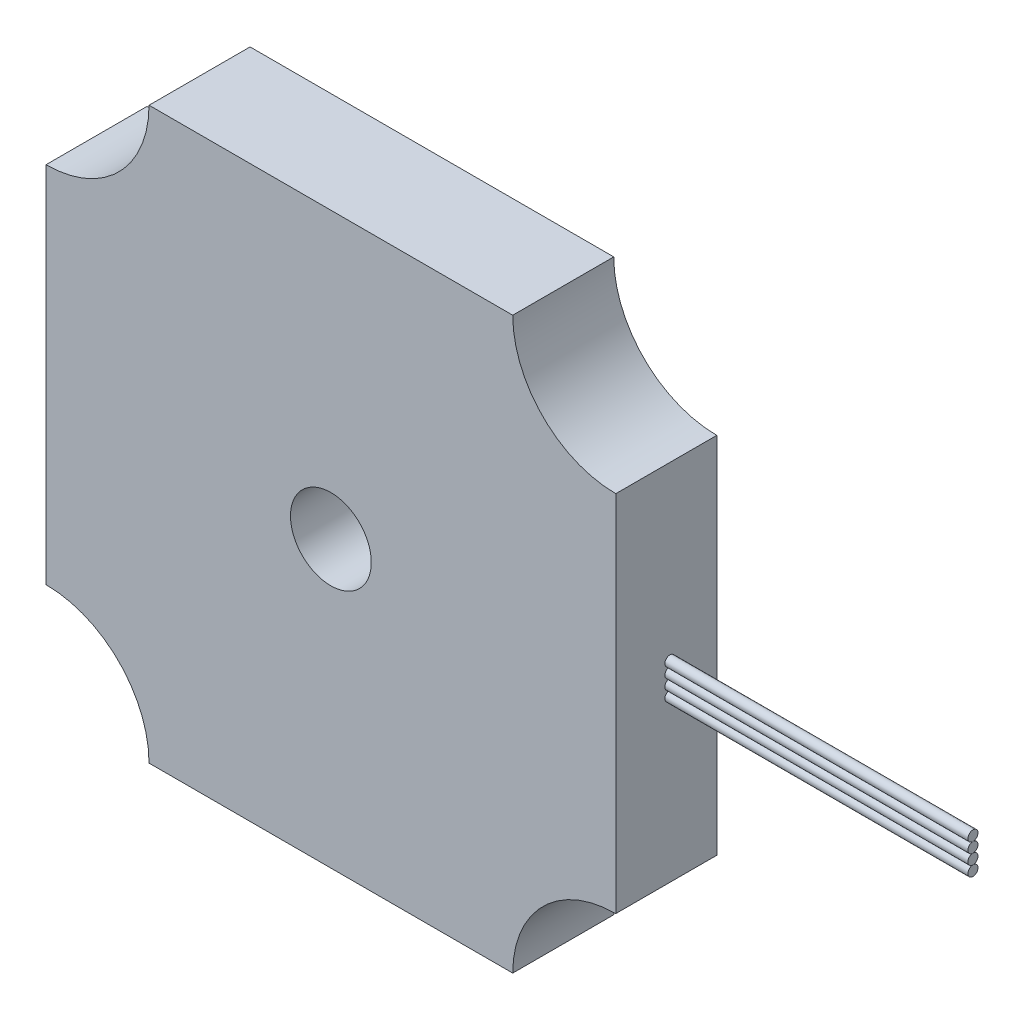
ISO-10303-21;
HEADER;
FILE_DESCRIPTION(('STEP AP214'),'2;1');
FILE_NAME('part.step','',(''),(''),'','','');
FILE_SCHEMA(('AUTOMOTIVE_DESIGN { 1 0 10303 214 1 1 1 1 }'));
ENDSEC;
DATA;
#1=APPLICATION_CONTEXT('core data for automotive mechanical design processes');
#2=APPLICATION_PROTOCOL_DEFINITION('international standard','automotive_design',2000,#1);
#3=PRODUCT_CONTEXT('',#1,'mechanical');
#4=PRODUCT('Part','Part','',(#3));
#5=PRODUCT_RELATED_PRODUCT_CATEGORY('part','',(#4));
#6=PRODUCT_DEFINITION_FORMATION('','',#4);
#7=PRODUCT_DEFINITION_CONTEXT('part definition',#1,'design');
#8=PRODUCT_DEFINITION('design','',#6,#7);
#9=PRODUCT_DEFINITION_SHAPE('','',#8);
#10=(LENGTH_UNIT() NAMED_UNIT(*) SI_UNIT(.MILLI.,.METRE.));
#11=(NAMED_UNIT(*) PLANE_ANGLE_UNIT() SI_UNIT($,.RADIAN.));
#12=(NAMED_UNIT(*) SI_UNIT($,.STERADIAN.) SOLID_ANGLE_UNIT());
#13=UNCERTAINTY_MEASURE_WITH_UNIT(LENGTH_MEASURE(1.E-05),#10,'distance_accuracy_value','');
#14=(GEOMETRIC_REPRESENTATION_CONTEXT(3) GLOBAL_UNCERTAINTY_ASSIGNED_CONTEXT((#13)) GLOBAL_UNIT_ASSIGNED_CONTEXT((#10,
#11,#12)) REPRESENTATION_CONTEXT('',''));
#15=CARTESIAN_POINT('',(0.,0.,0.));
#16=DIRECTION('',(0.,0.,1.));
#17=DIRECTION('',(1.,0.,0.));
#18=AXIS2_PLACEMENT_3D('',#15,#16,#17);
#19=CARTESIAN_POINT('',(58.2,-2.,4.64344868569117));
#20=DIRECTION('',(-1.,0.,0.));
#21=DIRECTION('',(0.,0.,1.));
#22=AXIS2_PLACEMENT_3D('',#19,#20,#21);
#23=CYLINDRICAL_SURFACE('',#22,0.500000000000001);
#24=CARTESIAN_POINT('',(28.2,-2.,4.64344868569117));
#25=DIRECTION('',(1.,0.,0.));
#26=DIRECTION('',(0.,0.,-1.));
#27=AXIS2_PLACEMENT_3D('',#24,#25,#26);
#28=CIRCLE('',#27,0.500000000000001);
#29=CARTESIAN_POINT('',(28.2,-2.,4.14344868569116));
#30=VERTEX_POINT('',#29);
#31=EDGE_CURVE('E12',#30,#30,#28,.T.);
#32=ORIENTED_EDGE('',*,*,#31,.T.);
#33=EDGE_LOOP('',(#32));
#34=FACE_BOUND('',#33,.T.);
#35=CARTESIAN_POINT('',(58.2,-2.,4.64344868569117));
#36=DIRECTION('',(1.,0.,0.));
#37=DIRECTION('',(0.,0.,-1.));
#38=AXIS2_PLACEMENT_3D('',#35,#36,#37);
#39=CIRCLE('',#38,0.500000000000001);
#40=CARTESIAN_POINT('',(58.2,-2.,4.14344868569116));
#41=VERTEX_POINT('',#40);
#42=EDGE_CURVE('E56',#41,#41,#39,.T.);
#43=ORIENTED_EDGE('',*,*,#42,.F.);
#44=EDGE_LOOP('',(#43));
#45=FACE_BOUND('',#44,.T.);
#46=ADVANCED_FACE('F52',(#34,#45),#23,.T.);
#47=CARTESIAN_POINT('',(58.2,-2.,4.64344868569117));
#48=DIRECTION('',(1.,0.,0.));
#49=DIRECTION('',(0.,0.,-1.));
#50=AXIS2_PLACEMENT_3D('',#47,#48,#49);
#51=PLANE('',#50);
#52=ORIENTED_EDGE('',*,*,#42,.T.);
#53=EDGE_LOOP('',(#52));
#54=FACE_BOUND('',#53,.T.);
#55=ADVANCED_FACE('F54',(#54),#51,.T.);
#56=CARTESIAN_POINT('',(28.2,-2.,4.64344868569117));
#57=DIRECTION('',(1.,0.,0.));
#58=DIRECTION('',(0.,0.,-1.));
#59=AXIS2_PLACEMENT_3D('',#56,#57,#58);
#60=PLANE('',#59);
#61=ORIENTED_EDGE('',*,*,#31,.F.);
#62=EDGE_LOOP('',(#61));
#63=FACE_BOUND('',#62,.T.);
#64=ADVANCED_FACE('F71',(#63),#60,.F.);
#65=CLOSED_SHELL('',(#46,#55,#64));
#66=MANIFOLD_SOLID_BREP('B2',#65);
#67=CARTESIAN_POINT('',(58.2,-1.,4.64344868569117));
#68=DIRECTION('',(-1.,0.,0.));
#69=DIRECTION('',(0.,0.,1.));
#70=AXIS2_PLACEMENT_3D('',#67,#68,#69);
#71=CYLINDRICAL_SURFACE('',#70,0.500000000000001);
#72=CARTESIAN_POINT('',(28.2,-1.,4.64344868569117));
#73=DIRECTION('',(1.,0.,0.));
#74=DIRECTION('',(0.,0.,-1.));
#75=AXIS2_PLACEMENT_3D('',#72,#73,#74);
#76=CIRCLE('',#75,0.500000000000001);
#77=CARTESIAN_POINT('',(28.2,-1.,4.14344868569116));
#78=VERTEX_POINT('',#77);
#79=EDGE_CURVE('E51',#78,#78,#76,.T.);
#80=ORIENTED_EDGE('',*,*,#79,.T.);
#81=EDGE_LOOP('',(#80));
#82=FACE_BOUND('',#81,.T.);
#83=CARTESIAN_POINT('',(58.2,-1.,4.64344868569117));
#84=DIRECTION('',(1.,0.,0.));
#85=DIRECTION('',(0.,0.,-1.));
#86=AXIS2_PLACEMENT_3D('',#83,#84,#85);
#87=CIRCLE('',#86,0.500000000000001);
#88=CARTESIAN_POINT('',(58.2,-1.,4.14344868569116));
#89=VERTEX_POINT('',#88);
#90=EDGE_CURVE('E105',#89,#89,#87,.T.);
#91=ORIENTED_EDGE('',*,*,#90,.F.);
#92=EDGE_LOOP('',(#91));
#93=FACE_BOUND('',#92,.T.);
#94=ADVANCED_FACE('F101',(#82,#93),#71,.T.);
#95=CARTESIAN_POINT('',(58.2,-1.,4.64344868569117));
#96=DIRECTION('',(1.,0.,0.));
#97=DIRECTION('',(0.,0.,-1.));
#98=AXIS2_PLACEMENT_3D('',#95,#96,#97);
#99=PLANE('',#98);
#100=ORIENTED_EDGE('',*,*,#90,.T.);
#101=EDGE_LOOP('',(#100));
#102=FACE_BOUND('',#101,.T.);
#103=ADVANCED_FACE('F103',(#102),#99,.T.);
#104=CARTESIAN_POINT('',(28.2,-1.,4.64344868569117));
#105=DIRECTION('',(1.,0.,0.));
#106=DIRECTION('',(0.,0.,-1.));
#107=AXIS2_PLACEMENT_3D('',#104,#105,#106);
#108=PLANE('',#107);
#109=ORIENTED_EDGE('',*,*,#79,.F.);
#110=EDGE_LOOP('',(#109));
#111=FACE_BOUND('',#110,.T.);
#112=ADVANCED_FACE('F120',(#111),#108,.F.);
#113=CLOSED_SHELL('',(#94,#103,#112));
#114=MANIFOLD_SOLID_BREP('B7',#113);
#115=CARTESIAN_POINT('',(58.2,0.,4.64344868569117));
#116=DIRECTION('',(-1.,0.,0.));
#117=DIRECTION('',(0.,0.,1.));
#118=AXIS2_PLACEMENT_3D('',#115,#116,#117);
#119=CYLINDRICAL_SURFACE('',#118,0.500000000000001);
#120=CARTESIAN_POINT('',(28.2,0.,4.64344868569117));
#121=DIRECTION('',(1.,0.,0.));
#122=DIRECTION('',(0.,0.,-1.));
#123=AXIS2_PLACEMENT_3D('',#120,#121,#122);
#124=CIRCLE('',#123,0.500000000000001);
#125=CARTESIAN_POINT('',(28.2,0.,4.14344868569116));
#126=VERTEX_POINT('',#125);
#127=EDGE_CURVE('E100',#126,#126,#124,.T.);
#128=ORIENTED_EDGE('',*,*,#127,.T.);
#129=EDGE_LOOP('',(#128));
#130=FACE_BOUND('',#129,.T.);
#131=CARTESIAN_POINT('',(58.2,0.,4.64344868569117));
#132=DIRECTION('',(1.,0.,0.));
#133=DIRECTION('',(0.,0.,-1.));
#134=AXIS2_PLACEMENT_3D('',#131,#132,#133);
#135=CIRCLE('',#134,0.500000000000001);
#136=CARTESIAN_POINT('',(58.2,0.,4.14344868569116));
#137=VERTEX_POINT('',#136);
#138=EDGE_CURVE('E154',#137,#137,#135,.T.);
#139=ORIENTED_EDGE('',*,*,#138,.F.);
#140=EDGE_LOOP('',(#139));
#141=FACE_BOUND('',#140,.T.);
#142=ADVANCED_FACE('F150',(#130,#141),#119,.T.);
#143=CARTESIAN_POINT('',(58.2,0.,4.64344868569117));
#144=DIRECTION('',(1.,0.,0.));
#145=DIRECTION('',(0.,0.,-1.));
#146=AXIS2_PLACEMENT_3D('',#143,#144,#145);
#147=PLANE('',#146);
#148=ORIENTED_EDGE('',*,*,#138,.T.);
#149=EDGE_LOOP('',(#148));
#150=FACE_BOUND('',#149,.T.);
#151=ADVANCED_FACE('F152',(#150),#147,.T.);
#152=CARTESIAN_POINT('',(28.2,0.,4.64344868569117));
#153=DIRECTION('',(1.,0.,0.));
#154=DIRECTION('',(0.,0.,-1.));
#155=AXIS2_PLACEMENT_3D('',#152,#153,#154);
#156=PLANE('',#155);
#157=ORIENTED_EDGE('',*,*,#127,.F.);
#158=EDGE_LOOP('',(#157));
#159=FACE_BOUND('',#158,.T.);
#160=ADVANCED_FACE('F169',(#159),#156,.F.);
#161=CLOSED_SHELL('',(#142,#151,#160));
#162=MANIFOLD_SOLID_BREP('B46',#161);
#163=CARTESIAN_POINT('',(58.2,1.,4.64344868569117));
#164=DIRECTION('',(-1.,0.,0.));
#165=DIRECTION('',(0.,0.,1.));
#166=AXIS2_PLACEMENT_3D('',#163,#164,#165);
#167=CYLINDRICAL_SURFACE('',#166,0.500000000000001);
#168=CARTESIAN_POINT('',(28.2,1.,4.64344868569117));
#169=DIRECTION('',(1.,0.,0.));
#170=DIRECTION('',(0.,0.,-1.));
#171=AXIS2_PLACEMENT_3D('',#168,#169,#170);
#172=CIRCLE('',#171,0.500000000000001);
#173=CARTESIAN_POINT('',(28.2,1.,4.14344868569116));
#174=VERTEX_POINT('',#173);
#175=EDGE_CURVE('E203',#174,#174,#172,.T.);
#176=ORIENTED_EDGE('',*,*,#175,.T.);
#177=EDGE_LOOP('',(#176));
#178=FACE_BOUND('',#177,.T.);
#179=CARTESIAN_POINT('',(58.2,1.,4.64344868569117));
#180=DIRECTION('',(1.,0.,0.));
#181=DIRECTION('',(0.,0.,-1.));
#182=AXIS2_PLACEMENT_3D('',#179,#180,#181);
#183=CIRCLE('',#182,0.500000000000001);
#184=CARTESIAN_POINT('',(58.2,1.,4.14344868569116));
#185=VERTEX_POINT('',#184);
#186=EDGE_CURVE('E149',#185,#185,#183,.T.);
#187=ORIENTED_EDGE('',*,*,#186,.F.);
#188=EDGE_LOOP('',(#187));
#189=FACE_BOUND('',#188,.T.);
#190=ADVANCED_FACE('F200',(#178,#189),#167,.T.);
#191=CARTESIAN_POINT('',(58.2,1.,4.64344868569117));
#192=DIRECTION('',(1.,0.,0.));
#193=DIRECTION('',(0.,0.,-1.));
#194=AXIS2_PLACEMENT_3D('',#191,#192,#193);
#195=PLANE('',#194);
#196=ORIENTED_EDGE('',*,*,#186,.T.);
#197=EDGE_LOOP('',(#196));
#198=FACE_BOUND('',#197,.T.);
#199=ADVANCED_FACE('F216',(#198),#195,.T.);
#200=CARTESIAN_POINT('',(28.2,1.,4.64344868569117));
#201=DIRECTION('',(1.,0.,0.));
#202=DIRECTION('',(0.,0.,-1.));
#203=AXIS2_PLACEMENT_3D('',#200,#201,#202);
#204=PLANE('',#203);
#205=ORIENTED_EDGE('',*,*,#175,.F.);
#206=EDGE_LOOP('',(#205));
#207=FACE_BOUND('',#206,.T.);
#208=ADVANCED_FACE('F214',(#207),#204,.F.);
#209=CLOSED_SHELL('',(#190,#199,#208));
#210=MANIFOLD_SOLID_BREP('B95',#209);
#211=CARTESIAN_POINT('',(-28.2,28.2,10.));
#212=DIRECTION('',(0.,0.,-1.));
#213=DIRECTION('',(-1.,0.,0.));
#214=AXIS2_PLACEMENT_3D('',#211,#212,#213);
#215=CYLINDRICAL_SURFACE('',#214,10.2);
#216=CARTESIAN_POINT('',(-28.2,28.2,0.));
#217=DIRECTION('',(0.,0.,-1.));
#218=DIRECTION('',(1.,0.,0.));
#219=AXIS2_PLACEMENT_3D('',#216,#217,#218);
#220=CIRCLE('',#219,10.2);
#221=CARTESIAN_POINT('',(-18.,28.2,0.));
#222=VERTEX_POINT('',#221);
#223=CARTESIAN_POINT('',(-28.2,18.,0.));
#224=VERTEX_POINT('',#223);
#225=EDGE_CURVE('E337',#222,#224,#220,.T.);
#226=ORIENTED_EDGE('',*,*,#225,.T.);
#227=DIRECTION('',(0.,0.,-1.));
#228=VECTOR('',#227,1.);
#229=CARTESIAN_POINT('',(-28.2,18.,10.));
#230=LINE('',#229,#228);
#231=CARTESIAN_POINT('',(-28.2,18.,10.));
#232=VERTEX_POINT('',#231);
#233=EDGE_CURVE('E198',#232,#224,#230,.T.);
#234=ORIENTED_EDGE('',*,*,#233,.F.);
#235=CARTESIAN_POINT('',(-28.2,28.2,10.));
#236=DIRECTION('',(0.,0.,-1.));
#237=DIRECTION('',(1.,0.,0.));
#238=AXIS2_PLACEMENT_3D('',#235,#236,#237);
#239=CIRCLE('',#238,10.2);
#240=CARTESIAN_POINT('',(-18.,28.2,10.));
#241=VERTEX_POINT('',#240);
#242=EDGE_CURVE('E352',#241,#232,#239,.T.);
#243=ORIENTED_EDGE('',*,*,#242,.F.);
#244=DIRECTION('',(0.,0.,-1.));
#245=VECTOR('',#244,1.);
#246=CARTESIAN_POINT('',(-18.,28.2,10.));
#247=LINE('',#246,#245);
#248=EDGE_CURVE('E333',#241,#222,#247,.T.);
#249=ORIENTED_EDGE('',*,*,#248,.T.);
#250=EDGE_LOOP('',(#226,#234,#243,#249));
#251=FACE_BOUND('',#250,.T.);
#252=ADVANCED_FACE('F241',(#251),#215,.F.);
#253=CARTESIAN_POINT('',(-28.2,-18.,10.));
#254=DIRECTION('',(1.,0.,0.));
#255=DIRECTION('',(0.,0.,-1.));
#256=AXIS2_PLACEMENT_3D('',#253,#254,#255);
#257=PLANE('',#256);
#258=DIRECTION('',(0.,-1.,0.));
#259=VECTOR('',#258,1.);
#260=CARTESIAN_POINT('',(-28.2,-18.,0.));
#261=LINE('',#260,#259);
#262=CARTESIAN_POINT('',(-28.2,-18.,0.));
#263=VERTEX_POINT('',#262);
#264=EDGE_CURVE('E340',#224,#263,#261,.T.);
#265=ORIENTED_EDGE('',*,*,#264,.T.);
#266=DIRECTION('',(0.,0.,-1.));
#267=VECTOR('',#266,1.);
#268=CARTESIAN_POINT('',(-28.2,-18.,10.));
#269=LINE('',#268,#267);
#270=CARTESIAN_POINT('',(-28.2,-18.,10.));
#271=VERTEX_POINT('',#270);
#272=EDGE_CURVE('E249',#271,#263,#269,.T.);
#273=ORIENTED_EDGE('',*,*,#272,.F.);
#274=DIRECTION('',(0.,-1.,0.));
#275=VECTOR('',#274,1.);
#276=CARTESIAN_POINT('',(-28.2,-18.,10.));
#277=LINE('',#276,#275);
#278=EDGE_CURVE('E300',#232,#271,#277,.T.);
#279=ORIENTED_EDGE('',*,*,#278,.F.);
#280=ORIENTED_EDGE('',*,*,#233,.T.);
#281=EDGE_LOOP('',(#265,#273,#279,#280));
#282=FACE_BOUND('',#281,.T.);
#283=ADVANCED_FACE('F407',(#282),#257,.F.);
#284=CARTESIAN_POINT('',(-28.2,-28.2,10.));
#285=DIRECTION('',(0.,0.,-1.));
#286=DIRECTION('',(-1.,0.,0.));
#287=AXIS2_PLACEMENT_3D('',#284,#285,#286);
#288=CYLINDRICAL_SURFACE('',#287,10.2);
#289=CARTESIAN_POINT('',(-28.2,-28.2,0.));
#290=DIRECTION('',(0.,0.,-1.));
#291=DIRECTION('',(1.,0.,0.));
#292=AXIS2_PLACEMENT_3D('',#289,#290,#291);
#293=CIRCLE('',#292,10.2);
#294=CARTESIAN_POINT('',(-18.,-28.2,0.));
#295=VERTEX_POINT('',#294);
#296=EDGE_CURVE('E343',#263,#295,#293,.T.);
#297=ORIENTED_EDGE('',*,*,#296,.T.);
#298=DIRECTION('',(0.,0.,-1.));
#299=VECTOR('',#298,1.);
#300=CARTESIAN_POINT('',(-18.,-28.2,10.));
#301=LINE('',#300,#299);
#302=CARTESIAN_POINT('',(-18.,-28.2,10.));
#303=VERTEX_POINT('',#302);
#304=EDGE_CURVE('E359',#303,#295,#301,.T.);
#305=ORIENTED_EDGE('',*,*,#304,.F.);
#306=CARTESIAN_POINT('',(-28.2,-28.2,10.));
#307=DIRECTION('',(0.,0.,-1.));
#308=DIRECTION('',(1.,0.,0.));
#309=AXIS2_PLACEMENT_3D('',#306,#307,#308);
#310=CIRCLE('',#309,10.2);
#311=EDGE_CURVE('E367',#271,#303,#310,.T.);
#312=ORIENTED_EDGE('',*,*,#311,.F.);
#313=ORIENTED_EDGE('',*,*,#272,.T.);
#314=EDGE_LOOP('',(#297,#305,#312,#313));
#315=FACE_BOUND('',#314,.T.);
#316=ADVANCED_FACE('F365',(#315),#288,.F.);
#317=CARTESIAN_POINT('',(-18.,-28.2,10.));
#318=DIRECTION('',(0.,1.,0.));
#319=DIRECTION('',(0.,0.,1.));
#320=AXIS2_PLACEMENT_3D('',#317,#318,#319);
#321=PLANE('',#320);
#322=DIRECTION('',(1.,0.,0.));
#323=VECTOR('',#322,1.);
#324=CARTESIAN_POINT('',(-18.,-28.2,0.));
#325=LINE('',#324,#323);
#326=CARTESIAN_POINT('',(18.,-28.2,0.));
#327=VERTEX_POINT('',#326);
#328=EDGE_CURVE('E345',#295,#327,#325,.T.);
#329=ORIENTED_EDGE('',*,*,#328,.T.);
#330=DIRECTION('',(0.,0.,-1.));
#331=VECTOR('',#330,1.);
#332=CARTESIAN_POINT('',(18.,-28.2,10.));
#333=LINE('',#332,#331);
#334=CARTESIAN_POINT('',(18.,-28.2,10.));
#335=VERTEX_POINT('',#334);
#336=EDGE_CURVE('E356',#335,#327,#333,.T.);
#337=ORIENTED_EDGE('',*,*,#336,.F.);
#338=DIRECTION('',(1.,0.,0.));
#339=VECTOR('',#338,1.);
#340=CARTESIAN_POINT('',(-18.,-28.2,10.));
#341=LINE('',#340,#339);
#342=EDGE_CURVE('E379',#303,#335,#341,.T.);
#343=ORIENTED_EDGE('',*,*,#342,.F.);
#344=ORIENTED_EDGE('',*,*,#304,.T.);
#345=EDGE_LOOP('',(#329,#337,#343,#344));
#346=FACE_BOUND('',#345,.T.);
#347=ADVANCED_FACE('F375',(#346),#321,.F.);
#348=CARTESIAN_POINT('',(28.2,-28.2,10.));
#349=DIRECTION('',(0.,0.,-1.));
#350=DIRECTION('',(-1.,0.,0.));
#351=AXIS2_PLACEMENT_3D('',#348,#349,#350);
#352=CYLINDRICAL_SURFACE('',#351,10.2);
#353=CARTESIAN_POINT('',(28.2,-28.2,0.));
#354=DIRECTION('',(0.,0.,-1.));
#355=DIRECTION('',(1.,0.,0.));
#356=AXIS2_PLACEMENT_3D('',#353,#354,#355);
#357=CIRCLE('',#356,10.2);
#358=CARTESIAN_POINT('',(28.2,-18.,0.));
#359=VERTEX_POINT('',#358);
#360=EDGE_CURVE('E347',#327,#359,#357,.T.);
#361=ORIENTED_EDGE('',*,*,#360,.T.);
#362=DIRECTION('',(0.,0.,-1.));
#363=VECTOR('',#362,1.);
#364=CARTESIAN_POINT('',(28.2,-18.,10.));
#365=LINE('',#364,#363);
#366=CARTESIAN_POINT('',(28.2,-18.,10.));
#367=VERTEX_POINT('',#366);
#368=EDGE_CURVE('E328',#367,#359,#365,.T.);
#369=ORIENTED_EDGE('',*,*,#368,.F.);
#370=CARTESIAN_POINT('',(28.2,-28.2,10.));
#371=DIRECTION('',(0.,0.,-1.));
#372=DIRECTION('',(1.,0.,0.));
#373=AXIS2_PLACEMENT_3D('',#370,#371,#372);
#374=CIRCLE('',#373,10.2);
#375=EDGE_CURVE('E319',#335,#367,#374,.T.);
#376=ORIENTED_EDGE('',*,*,#375,.F.);
#377=ORIENTED_EDGE('',*,*,#336,.T.);
#378=EDGE_LOOP('',(#361,#369,#376,#377));
#379=FACE_BOUND('',#378,.T.);
#380=ADVANCED_FACE('F378',(#379),#352,.F.);
#381=CARTESIAN_POINT('',(28.2,-18.,10.));
#382=DIRECTION('',(-1.,0.,0.));
#383=DIRECTION('',(0.,0.,1.));
#384=AXIS2_PLACEMENT_3D('',#381,#382,#383);
#385=PLANE('',#384);
#386=DIRECTION('',(0.,1.,0.));
#387=VECTOR('',#386,1.);
#388=CARTESIAN_POINT('',(28.2,-18.,0.));
#389=LINE('',#388,#387);
#390=CARTESIAN_POINT('',(28.2,18.,0.));
#391=VERTEX_POINT('',#390);
#392=EDGE_CURVE('E327',#359,#391,#389,.T.);
#393=ORIENTED_EDGE('',*,*,#392,.T.);
#394=DIRECTION('',(0.,0.,-1.));
#395=VECTOR('',#394,1.);
#396=CARTESIAN_POINT('',(28.2,18.,10.));
#397=LINE('',#396,#395);
#398=CARTESIAN_POINT('',(28.2,18.,10.));
#399=VERTEX_POINT('',#398);
#400=EDGE_CURVE('E324',#399,#391,#397,.T.);
#401=ORIENTED_EDGE('',*,*,#400,.F.);
#402=DIRECTION('',(0.,1.,0.));
#403=VECTOR('',#402,1.);
#404=CARTESIAN_POINT('',(28.2,-18.,10.));
#405=LINE('',#404,#403);
#406=EDGE_CURVE('E313',#367,#399,#405,.T.);
#407=ORIENTED_EDGE('',*,*,#406,.F.);
#408=ORIENTED_EDGE('',*,*,#368,.T.);
#409=EDGE_LOOP('',(#393,#401,#407,#408));
#410=FACE_BOUND('',#409,.T.);
#411=ADVANCED_FACE('F325',(#410),#385,.F.);
#412=CARTESIAN_POINT('',(28.2,28.2,10.));
#413=DIRECTION('',(0.,0.,-1.));
#414=DIRECTION('',(-1.,0.,0.));
#415=AXIS2_PLACEMENT_3D('',#412,#413,#414);
#416=CYLINDRICAL_SURFACE('',#415,10.2);
#417=CARTESIAN_POINT('',(28.2,28.2,0.));
#418=DIRECTION('',(0.,0.,-1.));
#419=DIRECTION('',(1.,0.,0.));
#420=AXIS2_PLACEMENT_3D('',#417,#418,#419);
#421=CIRCLE('',#420,10.2);
#422=CARTESIAN_POINT('',(18.,28.2,0.));
#423=VERTEX_POINT('',#422);
#424=EDGE_CURVE('E286',#391,#423,#421,.T.);
#425=ORIENTED_EDGE('',*,*,#424,.T.);
#426=DIRECTION('',(0.,0.,-1.));
#427=VECTOR('',#426,1.);
#428=CARTESIAN_POINT('',(18.,28.2,10.));
#429=LINE('',#428,#427);
#430=CARTESIAN_POINT('',(18.,28.2,10.));
#431=VERTEX_POINT('',#430);
#432=EDGE_CURVE('E329',#431,#423,#429,.T.);
#433=ORIENTED_EDGE('',*,*,#432,.F.);
#434=CARTESIAN_POINT('',(28.2,28.2,10.));
#435=DIRECTION('',(0.,0.,-1.));
#436=DIRECTION('',(1.,0.,0.));
#437=AXIS2_PLACEMENT_3D('',#434,#435,#436);
#438=CIRCLE('',#437,10.2);
#439=EDGE_CURVE('E317',#399,#431,#438,.T.);
#440=ORIENTED_EDGE('',*,*,#439,.F.);
#441=ORIENTED_EDGE('',*,*,#400,.T.);
#442=EDGE_LOOP('',(#425,#433,#440,#441));
#443=FACE_BOUND('',#442,.T.);
#444=ADVANCED_FACE('F331',(#443),#416,.F.);
#445=CARTESIAN_POINT('',(18.,28.2,10.));
#446=DIRECTION('',(0.,-1.,0.));
#447=DIRECTION('',(0.,0.,-1.));
#448=AXIS2_PLACEMENT_3D('',#445,#446,#447);
#449=PLANE('',#448);
#450=DIRECTION('',(-1.,0.,0.));
#451=VECTOR('',#450,1.);
#452=CARTESIAN_POINT('',(18.,28.2,0.));
#453=LINE('',#452,#451);
#454=EDGE_CURVE('E292',#423,#222,#453,.T.);
#455=ORIENTED_EDGE('',*,*,#454,.T.);
#456=ORIENTED_EDGE('',*,*,#248,.F.);
#457=DIRECTION('',(-1.,0.,0.));
#458=VECTOR('',#457,1.);
#459=CARTESIAN_POINT('',(18.,28.2,10.));
#460=LINE('',#459,#458);
#461=EDGE_CURVE('E257',#431,#241,#460,.T.);
#462=ORIENTED_EDGE('',*,*,#461,.F.);
#463=ORIENTED_EDGE('',*,*,#432,.T.);
#464=EDGE_LOOP('',(#455,#456,#462,#463));
#465=FACE_BOUND('',#464,.T.);
#466=ADVANCED_FACE('F403',(#465),#449,.F.);
#467=CARTESIAN_POINT('',(-28.2,28.2,10.));
#468=DIRECTION('',(0.,0.,1.));
#469=DIRECTION('',(1.,0.,0.));
#470=AXIS2_PLACEMENT_3D('',#467,#468,#469);
#471=PLANE('',#470);
#472=CARTESIAN_POINT('',(0.,0.,10.));
#473=DIRECTION('',(0.,0.,-1.));
#474=DIRECTION('',(-1.,0.,0.));
#475=AXIS2_PLACEMENT_3D('',#472,#473,#474);
#476=CIRCLE('',#475,4.);
#477=CARTESIAN_POINT('',(-4.,0.,10.));
#478=VERTEX_POINT('',#477);
#479=EDGE_CURVE('E341',#478,#478,#476,.T.);
#480=ORIENTED_EDGE('',*,*,#479,.T.);
#481=EDGE_LOOP('',(#480));
#482=FACE_BOUND('',#481,.T.);
#483=ORIENTED_EDGE('',*,*,#242,.T.);
#484=ORIENTED_EDGE('',*,*,#278,.T.);
#485=ORIENTED_EDGE('',*,*,#311,.T.);
#486=ORIENTED_EDGE('',*,*,#342,.T.);
#487=ORIENTED_EDGE('',*,*,#375,.T.);
#488=ORIENTED_EDGE('',*,*,#406,.T.);
#489=ORIENTED_EDGE('',*,*,#439,.T.);
#490=ORIENTED_EDGE('',*,*,#461,.T.);
#491=EDGE_LOOP('',(#483,#484,#485,#486,#487,#488,#489,#490));
#492=FACE_BOUND('',#491,.T.);
#493=ADVANCED_FACE('F315',(#482,#492),#471,.T.);
#494=CARTESIAN_POINT('',(-28.2,28.2,0.));
#495=DIRECTION('',(0.,0.,1.));
#496=DIRECTION('',(1.,0.,0.));
#497=AXIS2_PLACEMENT_3D('',#494,#495,#496);
#498=PLANE('',#497);
#499=CARTESIAN_POINT('',(0.,0.,0.));
#500=DIRECTION('',(0.,0.,-1.));
#501=DIRECTION('',(-1.,0.,0.));
#502=AXIS2_PLACEMENT_3D('',#499,#500,#501);
#503=CIRCLE('',#502,4.);
#504=CARTESIAN_POINT('',(-4.,0.,0.));
#505=VERTEX_POINT('',#504);
#506=EDGE_CURVE('E385',#505,#505,#503,.T.);
#507=ORIENTED_EDGE('',*,*,#506,.F.);
#508=EDGE_LOOP('',(#507));
#509=FACE_BOUND('',#508,.T.);
#510=ORIENTED_EDGE('',*,*,#225,.F.);
#511=ORIENTED_EDGE('',*,*,#454,.F.);
#512=ORIENTED_EDGE('',*,*,#424,.F.);
#513=ORIENTED_EDGE('',*,*,#392,.F.);
#514=ORIENTED_EDGE('',*,*,#360,.F.);
#515=ORIENTED_EDGE('',*,*,#328,.F.);
#516=ORIENTED_EDGE('',*,*,#296,.F.);
#517=ORIENTED_EDGE('',*,*,#264,.F.);
#518=EDGE_LOOP('',(#510,#511,#512,#513,#514,#515,#516,#517));
#519=FACE_BOUND('',#518,.T.);
#520=ADVANCED_FACE('F371',(#509,#519),#498,.F.);
#521=CARTESIAN_POINT('',(0.,0.,10.));
#522=DIRECTION('',(0.,0.,-1.));
#523=DIRECTION('',(-1.,0.,0.));
#524=AXIS2_PLACEMENT_3D('',#521,#522,#523);
#525=CYLINDRICAL_SURFACE('',#524,4.);
#526=ORIENTED_EDGE('',*,*,#479,.F.);
#527=EDGE_LOOP('',(#526));
#528=FACE_BOUND('',#527,.T.);
#529=ORIENTED_EDGE('',*,*,#506,.T.);
#530=EDGE_LOOP('',(#529));
#531=FACE_BOUND('',#530,.T.);
#532=ADVANCED_FACE('F392',(#528,#531),#525,.F.);
#533=CLOSED_SHELL('',(#252,#283,#316,#347,#380,#411,#444,#466,#493,#520,#532));
#534=MANIFOLD_SOLID_BREP('B144',#533);
#535=ADVANCED_BREP_SHAPE_REPRESENTATION('',(#18,#66,#114,#162,#210,#534),#14);
#536=SHAPE_DEFINITION_REPRESENTATION(#9,#535);
ENDSEC;
END-ISO-10303-21;
